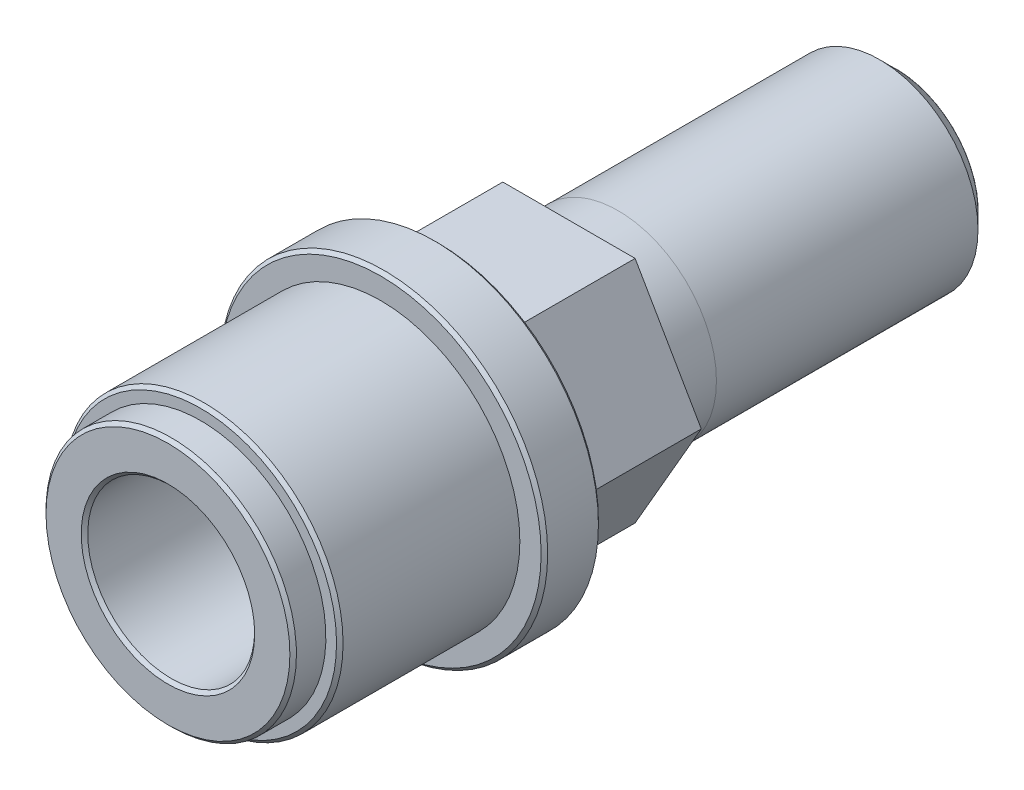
ISO-10303-21;
HEADER;
FILE_DESCRIPTION(('STEP AP214'),'2;1');
FILE_NAME('part.step','',(''),(''),'','','');
FILE_SCHEMA(('AUTOMOTIVE_DESIGN { 1 0 10303 214 1 1 1 1 }'));
ENDSEC;
DATA;
#1=APPLICATION_CONTEXT('core data for automotive mechanical design processes');
#2=APPLICATION_PROTOCOL_DEFINITION('international standard','automotive_design',2000,#1);
#3=PRODUCT_CONTEXT('',#1,'mechanical');
#4=PRODUCT('Part','Part','',(#3));
#5=PRODUCT_RELATED_PRODUCT_CATEGORY('part','',(#4));
#6=PRODUCT_DEFINITION_FORMATION('','',#4);
#7=PRODUCT_DEFINITION_CONTEXT('part definition',#1,'design');
#8=PRODUCT_DEFINITION('design','',#6,#7);
#9=PRODUCT_DEFINITION_SHAPE('','',#8);
#10=(LENGTH_UNIT() NAMED_UNIT(*) SI_UNIT(.MILLI.,.METRE.));
#11=(NAMED_UNIT(*) PLANE_ANGLE_UNIT() SI_UNIT($,.RADIAN.));
#12=(NAMED_UNIT(*) SI_UNIT($,.STERADIAN.) SOLID_ANGLE_UNIT());
#13=UNCERTAINTY_MEASURE_WITH_UNIT(LENGTH_MEASURE(1.E-05),#10,'distance_accuracy_value','');
#14=(GEOMETRIC_REPRESENTATION_CONTEXT(3) GLOBAL_UNCERTAINTY_ASSIGNED_CONTEXT((#13)) GLOBAL_UNIT_ASSIGNED_CONTEXT((#10,
#11,#12)) REPRESENTATION_CONTEXT('',''));
#15=CARTESIAN_POINT('',(0.,0.,0.));
#16=DIRECTION('',(0.,0.,1.));
#17=DIRECTION('',(1.,0.,0.));
#18=AXIS2_PLACEMENT_3D('',#15,#16,#17);
#19=CARTESIAN_POINT('',(0.505163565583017,-7.63330267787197,32.8));
#20=DIRECTION('',(0.,0.,1.));
#21=DIRECTION('',(-0.997817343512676,-0.0660344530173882,0.));
#22=AXIS2_PLACEMENT_3D('',#19,#20,#21);
#23=PLANE('',#22);
#24=CARTESIAN_POINT('',(0.,0.,32.8));
#25=DIRECTION('',(0.,0.,1.));
#26=DIRECTION('',(-0.997817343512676,-0.0660344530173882,0.));
#27=AXIS2_PLACEMENT_3D('',#24,#25,#26);
#28=CIRCLE('',#27,8.3);
#29=CARTESIAN_POINT('',(-8.28188395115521,-0.548085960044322,32.8));
#30=VERTEX_POINT('',#29);
#31=EDGE_CURVE('E9',#30,#30,#28,.T.);
#32=ORIENTED_EDGE('',*,*,#31,.T.);
#33=EDGE_LOOP('',(#32));
#34=FACE_BOUND('',#33,.T.);
#35=CARTESIAN_POINT('',(0.,0.,32.8));
#36=DIRECTION('',(0.,0.,-1.));
#37=DIRECTION('',(0.997817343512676,0.0660344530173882,0.));
#38=AXIS2_PLACEMENT_3D('',#35,#36,#37);
#39=CIRCLE('',#38,7.65);
#40=CARTESIAN_POINT('',(7.63330267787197,0.50516356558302,32.8));
#41=VERTEX_POINT('',#40);
#42=EDGE_CURVE('E139',#41,#41,#39,.T.);
#43=ORIENTED_EDGE('',*,*,#42,.T.);
#44=EDGE_LOOP('',(#43));
#45=FACE_BOUND('',#44,.T.);
#46=ADVANCED_FACE('F14',(#34,#45),#23,.T.);
#47=CARTESIAN_POINT('',(0.,0.,24.3));
#48=DIRECTION('',(0.,0.,-1.));
#49=DIRECTION('',(0.997817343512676,0.0660344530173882,0.));
#50=AXIS2_PLACEMENT_3D('',#47,#48,#49);
#51=CYLINDRICAL_SURFACE('',#50,8.5);
#52=CARTESIAN_POINT('',(0.,0.,32.6));
#53=DIRECTION('',(0.,0.,1.));
#54=DIRECTION('',(-0.997817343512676,-0.0660344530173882,0.));
#55=AXIS2_PLACEMENT_3D('',#52,#53,#54);
#56=CIRCLE('',#55,8.5);
#57=CARTESIAN_POINT('',(-8.48144741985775,-0.5612928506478,32.6));
#58=VERTEX_POINT('',#57);
#59=EDGE_CURVE('E23',#58,#58,#56,.F.);
#60=ORIENTED_EDGE('',*,*,#59,.T.);
#61=EDGE_LOOP('',(#60));
#62=FACE_BOUND('',#61,.T.);
#63=CARTESIAN_POINT('',(0.,0.,21.8));
#64=DIRECTION('',(0.,0.,-1.));
#65=DIRECTION('',(1.,0.,0.));
#66=AXIS2_PLACEMENT_3D('',#63,#64,#65);
#67=CIRCLE('',#66,8.5);
#68=CARTESIAN_POINT('',(8.5,0.,21.8));
#69=VERTEX_POINT('',#68);
#70=EDGE_CURVE('E123',#69,#69,#67,.T.);
#71=ORIENTED_EDGE('',*,*,#70,.F.);
#72=EDGE_LOOP('',(#71));
#73=FACE_BOUND('',#72,.T.);
#74=ADVANCED_FACE('F280',(#62,#73),#51,.T.);
#75=CARTESIAN_POINT('',(0.,0.,32.6));
#76=DIRECTION('',(0.,0.,-1.));
#77=DIRECTION('',(0.997817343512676,0.0660344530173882,0.));
#78=AXIS2_PLACEMENT_3D('',#75,#76,#77);
#79=CONICAL_SURFACE('',#78,8.5,0.78539816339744);
#80=ORIENTED_EDGE('',*,*,#31,.F.);
#81=EDGE_LOOP('',(#80));
#82=FACE_BOUND('',#81,.T.);
#83=ORIENTED_EDGE('',*,*,#59,.F.);
#84=EDGE_LOOP('',(#83));
#85=FACE_BOUND('',#84,.T.);
#86=ADVANCED_FACE('F282',(#82,#85),#79,.T.);
#87=CARTESIAN_POINT('',(0.,0.,-9.69));
#88=DIRECTION('',(0.,0.,1.));
#89=DIRECTION('',(-1.,0.,0.));
#90=AXIS2_PLACEMENT_3D('',#87,#88,#89);
#91=CONICAL_SURFACE('',#90,5.,0.785398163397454);
#92=CARTESIAN_POINT('',(0.,0.,-8.69));
#93=DIRECTION('',(0.,0.,-1.));
#94=DIRECTION('',(1.,0.,0.));
#95=AXIS2_PLACEMENT_3D('',#92,#93,#94);
#96=CIRCLE('',#95,6.);
#97=CARTESIAN_POINT('',(6.,0.,-8.69));
#98=VERTEX_POINT('',#97);
#99=EDGE_CURVE('E99',#98,#98,#96,.T.);
#100=ORIENTED_EDGE('',*,*,#99,.T.);
#101=EDGE_LOOP('',(#100));
#102=FACE_BOUND('',#101,.T.);
#103=CARTESIAN_POINT('',(0.,0.,-9.69));
#104=DIRECTION('',(0.,0.,-1.));
#105=DIRECTION('',(1.,0.,0.));
#106=AXIS2_PLACEMENT_3D('',#103,#104,#105);
#107=CIRCLE('',#106,5.);
#108=CARTESIAN_POINT('',(5.,0.,-9.69));
#109=VERTEX_POINT('',#108);
#110=EDGE_CURVE('E96',#109,#109,#107,.T.);
#111=ORIENTED_EDGE('',*,*,#110,.F.);
#112=EDGE_LOOP('',(#111));
#113=FACE_BOUND('',#112,.T.);
#114=ADVANCED_FACE('F248',(#102,#113),#91,.T.);
#115=CARTESIAN_POINT('',(0.,0.,2.8));
#116=DIRECTION('',(0.,0.,-1.));
#117=DIRECTION('',(1.,0.,0.));
#118=AXIS2_PLACEMENT_3D('',#115,#116,#117);
#119=CYLINDRICAL_SURFACE('',#118,6.);
#120=ORIENTED_EDGE('',*,*,#99,.F.);
#121=EDGE_LOOP('',(#120));
#122=FACE_BOUND('',#121,.T.);
#123=CARTESIAN_POINT('',(0.,0.,7.3));
#124=DIRECTION('',(0.,0.,-1.));
#125=DIRECTION('',(1.,0.,0.));
#126=AXIS2_PLACEMENT_3D('',#123,#124,#125);
#127=CIRCLE('',#126,6.);
#128=CARTESIAN_POINT('',(6.,0.,7.3));
#129=VERTEX_POINT('',#128);
#130=EDGE_CURVE('E155',#129,#129,#127,.T.);
#131=ORIENTED_EDGE('',*,*,#130,.T.);
#132=EDGE_LOOP('',(#131));
#133=FACE_BOUND('',#132,.T.);
#134=ADVANCED_FACE('F301',(#122,#133),#119,.T.);
#135=CARTESIAN_POINT('',(-6.,0.,7.3));
#136=DIRECTION('',(0.,0.,1.));
#137=DIRECTION('',(-1.,0.,0.));
#138=AXIS2_PLACEMENT_3D('',#135,#136,#137);
#139=PLANE('',#138);
#140=ORIENTED_EDGE('',*,*,#130,.F.);
#141=EDGE_LOOP('',(#140));
#142=FACE_BOUND('',#141,.T.);
#143=CARTESIAN_POINT('',(0.,0.,7.3));
#144=DIRECTION('',(0.,0.,-1.));
#145=DIRECTION('',(1.,0.,0.));
#146=AXIS2_PLACEMENT_3D('',#143,#144,#145);
#147=CIRCLE('',#146,6.01);
#148=CARTESIAN_POINT('',(6.01,0.,7.3));
#149=VERTEX_POINT('',#148);
#150=EDGE_CURVE('E152',#149,#149,#147,.T.);
#151=ORIENTED_EDGE('',*,*,#150,.T.);
#152=EDGE_LOOP('',(#151));
#153=FACE_BOUND('',#152,.T.);
#154=ADVANCED_FACE('F297',(#142,#153),#139,.F.);
#155=CARTESIAN_POINT('',(0.,0.,2.8));
#156=DIRECTION('',(0.,0.,-1.));
#157=DIRECTION('',(1.,0.,0.));
#158=AXIS2_PLACEMENT_3D('',#155,#156,#157);
#159=CYLINDRICAL_SURFACE('',#158,6.01);
#160=ORIENTED_EDGE('',*,*,#150,.F.);
#161=EDGE_LOOP('',(#160));
#162=FACE_BOUND('',#161,.T.);
#163=CARTESIAN_POINT('',(0.,0.,10.3));
#164=DIRECTION('',(0.,0.,-1.));
#165=DIRECTION('',(1.,0.,0.));
#166=AXIS2_PLACEMENT_3D('',#163,#164,#165);
#167=CIRCLE('',#166,6.01);
#168=CARTESIAN_POINT('',(6.01,0.,10.3));
#169=VERTEX_POINT('',#168);
#170=EDGE_CURVE('E149',#169,#169,#167,.T.);
#171=ORIENTED_EDGE('',*,*,#170,.T.);
#172=EDGE_LOOP('',(#171));
#173=FACE_BOUND('',#172,.T.);
#174=ADVANCED_FACE('F205',(#162,#173),#159,.T.);
#175=CARTESIAN_POINT('',(-8.5,0.,10.3));
#176=DIRECTION('',(0.,0.,-1.));
#177=DIRECTION('',(1.,0.,0.));
#178=AXIS2_PLACEMENT_3D('',#175,#176,#177);
#179=PLANE('',#178);
#180=ORIENTED_EDGE('',*,*,#170,.F.);
#181=EDGE_LOOP('',(#180));
#182=FACE_BOUND('',#181,.T.);
#183=DIRECTION('',(0.5,-0.866025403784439,0.));
#184=VECTOR('',#183,1.);
#185=CARTESIAN_POINT('',(4.04145188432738,7.,10.3));
#186=LINE('',#185,#184);
#187=CARTESIAN_POINT('',(4.04145188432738,7.,10.3));
#188=VERTEX_POINT('',#187);
#189=CARTESIAN_POINT('',(8.08290376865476,0.,10.3));
#190=VERTEX_POINT('',#189);
#191=EDGE_CURVE('E158',#188,#190,#186,.T.);
#192=ORIENTED_EDGE('',*,*,#191,.T.);
#193=DIRECTION('',(-0.5,-0.866025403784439,0.));
#194=VECTOR('',#193,1.);
#195=CARTESIAN_POINT('',(8.08290376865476,0.,10.3));
#196=LINE('',#195,#194);
#197=CARTESIAN_POINT('',(4.04145188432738,-7.,10.3));
#198=VERTEX_POINT('',#197);
#199=EDGE_CURVE('E31',#190,#198,#196,.T.);
#200=ORIENTED_EDGE('',*,*,#199,.T.);
#201=DIRECTION('',(-1.,0.,0.));
#202=VECTOR('',#201,1.);
#203=CARTESIAN_POINT('',(4.04145188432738,-7.,10.3));
#204=LINE('',#203,#202);
#205=CARTESIAN_POINT('',(-4.04145188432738,-7.,10.3));
#206=VERTEX_POINT('',#205);
#207=EDGE_CURVE('E165',#198,#206,#204,.T.);
#208=ORIENTED_EDGE('',*,*,#207,.T.);
#209=DIRECTION('',(-0.5,0.866025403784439,0.));
#210=VECTOR('',#209,1.);
#211=CARTESIAN_POINT('',(-4.04145188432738,-7.,10.3));
#212=LINE('',#211,#210);
#213=CARTESIAN_POINT('',(-8.08290376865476,0.,10.3));
#214=VERTEX_POINT('',#213);
#215=EDGE_CURVE('E168',#206,#214,#212,.T.);
#216=ORIENTED_EDGE('',*,*,#215,.T.);
#217=DIRECTION('',(0.5,0.866025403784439,0.));
#218=VECTOR('',#217,1.);
#219=CARTESIAN_POINT('',(-8.08290376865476,0.,10.3));
#220=LINE('',#219,#218);
#221=CARTESIAN_POINT('',(-4.04145188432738,7.,10.3));
#222=VERTEX_POINT('',#221);
#223=EDGE_CURVE('E79',#214,#222,#220,.T.);
#224=ORIENTED_EDGE('',*,*,#223,.T.);
#225=DIRECTION('',(1.,0.,0.));
#226=VECTOR('',#225,1.);
#227=CARTESIAN_POINT('',(-4.04145188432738,7.,10.3));
#228=LINE('',#227,#226);
#229=EDGE_CURVE('E92',#222,#188,#228,.T.);
#230=ORIENTED_EDGE('',*,*,#229,.T.);
#231=EDGE_LOOP('',(#192,#200,#208,#216,#224,#230));
#232=FACE_BOUND('',#231,.T.);
#233=ADVANCED_FACE('F184',(#182,#232),#179,.T.);
#234=CARTESIAN_POINT('',(4.04145188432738,-7.,42.582046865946));
#235=DIRECTION('',(0.,-1.,0.));
#236=DIRECTION('',(0.,0.,1.));
#237=AXIS2_PLACEMENT_3D('',#234,#235,#236);
#238=PLANE('',#237);
#239=DIRECTION('',(0.,0.,-1.));
#240=VECTOR('',#239,1.);
#241=CARTESIAN_POINT('',(-4.04145188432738,-7.,42.582046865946));
#242=LINE('',#241,#240);
#243=CARTESIAN_POINT('',(-4.04145188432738,-7.,18.3));
#244=VERTEX_POINT('',#243);
#245=EDGE_CURVE('E75',#244,#206,#242,.T.);
#246=ORIENTED_EDGE('',*,*,#245,.T.);
#247=ORIENTED_EDGE('',*,*,#207,.F.);
#248=DIRECTION('',(0.,0.,-1.));
#249=VECTOR('',#248,1.);
#250=CARTESIAN_POINT('',(4.04145188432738,-7.,42.582046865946));
#251=LINE('',#250,#249);
#252=CARTESIAN_POINT('',(4.04145188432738,-7.,18.3));
#253=VERTEX_POINT('',#252);
#254=EDGE_CURVE('E85',#253,#198,#251,.T.);
#255=ORIENTED_EDGE('',*,*,#254,.F.);
#256=DIRECTION('',(1.,0.,0.));
#257=VECTOR('',#256,1.);
#258=CARTESIAN_POINT('',(4.04145188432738,-7.,18.3));
#259=LINE('',#258,#257);
#260=EDGE_CURVE('E40',#244,#253,#259,.T.);
#261=ORIENTED_EDGE('',*,*,#260,.F.);
#262=EDGE_LOOP('',(#246,#247,#255,#261));
#263=FACE_BOUND('',#262,.T.);
#264=ADVANCED_FACE('F195',(#263),#238,.T.);
#265=CARTESIAN_POINT('',(-4.04145188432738,-7.,42.582046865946));
#266=DIRECTION('',(-0.866025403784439,-0.5,0.));
#267=DIRECTION('',(0.5,-0.866025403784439,0.));
#268=AXIS2_PLACEMENT_3D('',#265,#266,#267);
#269=PLANE('',#268);
#270=DIRECTION('',(0.,0.,-1.));
#271=VECTOR('',#270,1.);
#272=CARTESIAN_POINT('',(-8.08290376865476,0.,42.582046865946));
#273=LINE('',#272,#271);
#274=CARTESIAN_POINT('',(-8.08290376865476,0.,18.3));
#275=VERTEX_POINT('',#274);
#276=EDGE_CURVE('E72',#275,#214,#273,.T.);
#277=ORIENTED_EDGE('',*,*,#276,.T.);
#278=ORIENTED_EDGE('',*,*,#215,.F.);
#279=ORIENTED_EDGE('',*,*,#245,.F.);
#280=DIRECTION('',(0.5,-0.866025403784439,0.));
#281=VECTOR('',#280,1.);
#282=CARTESIAN_POINT('',(-4.04145188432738,-7.,18.3));
#283=LINE('',#282,#281);
#284=EDGE_CURVE('E58',#275,#244,#283,.T.);
#285=ORIENTED_EDGE('',*,*,#284,.F.);
#286=EDGE_LOOP('',(#277,#278,#279,#285));
#287=FACE_BOUND('',#286,.T.);
#288=ADVANCED_FACE('F69',(#287),#269,.T.);
#289=CARTESIAN_POINT('',(-8.08290376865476,0.,42.582046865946));
#290=DIRECTION('',(-0.866025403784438,0.5,0.));
#291=DIRECTION('',(-0.5,-0.866025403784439,0.));
#292=AXIS2_PLACEMENT_3D('',#289,#290,#291);
#293=PLANE('',#292);
#294=DIRECTION('',(0.,0.,-1.));
#295=VECTOR('',#294,1.);
#296=CARTESIAN_POINT('',(-4.04145188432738,7.,42.582046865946));
#297=LINE('',#296,#295);
#298=CARTESIAN_POINT('',(-4.04145188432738,7.,18.3));
#299=VERTEX_POINT('',#298);
#300=EDGE_CURVE('E81',#299,#222,#297,.T.);
#301=ORIENTED_EDGE('',*,*,#300,.T.);
#302=ORIENTED_EDGE('',*,*,#223,.F.);
#303=ORIENTED_EDGE('',*,*,#276,.F.);
#304=DIRECTION('',(-0.5,-0.866025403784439,0.));
#305=VECTOR('',#304,1.);
#306=CARTESIAN_POINT('',(-8.08290376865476,0.,18.3));
#307=LINE('',#306,#305);
#308=EDGE_CURVE('E55',#299,#275,#307,.T.);
#309=ORIENTED_EDGE('',*,*,#308,.F.);
#310=EDGE_LOOP('',(#301,#302,#303,#309));
#311=FACE_BOUND('',#310,.T.);
#312=ADVANCED_FACE('F77',(#311),#293,.T.);
#313=CARTESIAN_POINT('',(-4.04145188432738,7.,42.582046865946));
#314=DIRECTION('',(0.,1.,0.));
#315=DIRECTION('',(0.,0.,-1.));
#316=AXIS2_PLACEMENT_3D('',#313,#314,#315);
#317=PLANE('',#316);
#318=DIRECTION('',(0.,0.,-1.));
#319=VECTOR('',#318,1.);
#320=CARTESIAN_POINT('',(4.04145188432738,7.,42.582046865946));
#321=LINE('',#320,#319);
#322=CARTESIAN_POINT('',(4.04145188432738,7.,18.3));
#323=VERTEX_POINT('',#322);
#324=EDGE_CURVE('E83',#323,#188,#321,.T.);
#325=ORIENTED_EDGE('',*,*,#324,.T.);
#326=ORIENTED_EDGE('',*,*,#229,.F.);
#327=ORIENTED_EDGE('',*,*,#300,.F.);
#328=DIRECTION('',(-1.,0.,0.));
#329=VECTOR('',#328,1.);
#330=CARTESIAN_POINT('',(-4.04145188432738,7.,18.3));
#331=LINE('',#330,#329);
#332=EDGE_CURVE('E60',#323,#299,#331,.T.);
#333=ORIENTED_EDGE('',*,*,#332,.F.);
#334=EDGE_LOOP('',(#325,#326,#327,#333));
#335=FACE_BOUND('',#334,.T.);
#336=ADVANCED_FACE('F178',(#335),#317,.T.);
#337=CARTESIAN_POINT('',(4.04145188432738,7.,42.582046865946));
#338=DIRECTION('',(0.866025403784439,0.5,0.));
#339=DIRECTION('',(-0.5,0.866025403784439,0.));
#340=AXIS2_PLACEMENT_3D('',#337,#338,#339);
#341=PLANE('',#340);
#342=DIRECTION('',(0.,0.,-1.));
#343=VECTOR('',#342,1.);
#344=CARTESIAN_POINT('',(8.08290376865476,0.,42.582046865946));
#345=LINE('',#344,#343);
#346=CARTESIAN_POINT('',(8.08290376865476,0.,18.3));
#347=VERTEX_POINT('',#346);
#348=EDGE_CURVE('E90',#347,#190,#345,.T.);
#349=ORIENTED_EDGE('',*,*,#348,.T.);
#350=ORIENTED_EDGE('',*,*,#191,.F.);
#351=ORIENTED_EDGE('',*,*,#324,.F.);
#352=DIRECTION('',(-0.5,0.866025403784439,0.));
#353=VECTOR('',#352,1.);
#354=CARTESIAN_POINT('',(4.04145188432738,7.,18.3));
#355=LINE('',#354,#353);
#356=EDGE_CURVE('E95',#347,#323,#355,.T.);
#357=ORIENTED_EDGE('',*,*,#356,.F.);
#358=EDGE_LOOP('',(#349,#350,#351,#357));
#359=FACE_BOUND('',#358,.T.);
#360=ADVANCED_FACE('F182',(#359),#341,.T.);
#361=CARTESIAN_POINT('',(8.08290376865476,0.,42.582046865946));
#362=DIRECTION('',(0.866025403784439,-0.5,0.));
#363=DIRECTION('',(0.5,0.866025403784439,0.));
#364=AXIS2_PLACEMENT_3D('',#361,#362,#363);
#365=PLANE('',#364);
#366=ORIENTED_EDGE('',*,*,#254,.T.);
#367=ORIENTED_EDGE('',*,*,#199,.F.);
#368=ORIENTED_EDGE('',*,*,#348,.F.);
#369=DIRECTION('',(0.5,0.866025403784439,0.));
#370=VECTOR('',#369,1.);
#371=CARTESIAN_POINT('',(8.08290376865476,0.,18.3));
#372=LINE('',#371,#370);
#373=EDGE_CURVE('E93',#253,#347,#372,.T.);
#374=ORIENTED_EDGE('',*,*,#373,.F.);
#375=EDGE_LOOP('',(#366,#367,#368,#374));
#376=FACE_BOUND('',#375,.T.);
#377=ADVANCED_FACE('F193',(#376),#365,.T.);
#378=CARTESIAN_POINT('',(7.65,0.,18.3));
#379=DIRECTION('',(0.,0.,-1.));
#380=DIRECTION('',(1.,0.,0.));
#381=AXIS2_PLACEMENT_3D('',#378,#379,#380);
#382=PLANE('',#381);
#383=CARTESIAN_POINT('',(0.,0.,18.3));
#384=DIRECTION('',(0.,0.,-1.));
#385=DIRECTION('',(1.,0.,0.));
#386=AXIS2_PLACEMENT_3D('',#383,#384,#385);
#387=CIRCLE('',#386,9.8);
#388=CARTESIAN_POINT('',(9.8,0.,18.3));
#389=VERTEX_POINT('',#388);
#390=EDGE_CURVE('E126',#389,#389,#387,.T.);
#391=ORIENTED_EDGE('',*,*,#390,.T.);
#392=EDGE_LOOP('',(#391));
#393=FACE_BOUND('',#392,.T.);
#394=ORIENTED_EDGE('',*,*,#373,.T.);
#395=ORIENTED_EDGE('',*,*,#356,.T.);
#396=ORIENTED_EDGE('',*,*,#332,.T.);
#397=ORIENTED_EDGE('',*,*,#308,.T.);
#398=ORIENTED_EDGE('',*,*,#284,.T.);
#399=ORIENTED_EDGE('',*,*,#260,.T.);
#400=EDGE_LOOP('',(#394,#395,#396,#397,#398,#399));
#401=FACE_BOUND('',#400,.T.);
#402=ADVANCED_FACE('F57',(#393,#401),#382,.T.);
#403=CARTESIAN_POINT('',(0.,0.,18.3));
#404=DIRECTION('',(0.,0.,1.));
#405=DIRECTION('',(-1.,0.,0.));
#406=AXIS2_PLACEMENT_3D('',#403,#404,#405);
#407=CONICAL_SURFACE('',#406,9.8,0.785398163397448);
#408=CARTESIAN_POINT('',(0.,0.,18.5));
#409=DIRECTION('',(0.,0.,-1.));
#410=DIRECTION('',(1.,0.,0.));
#411=AXIS2_PLACEMENT_3D('',#408,#409,#410);
#412=CIRCLE('',#411,10.);
#413=CARTESIAN_POINT('',(10.,0.,18.5));
#414=VERTEX_POINT('',#413);
#415=EDGE_CURVE('E132',#414,#414,#412,.F.);
#416=ORIENTED_EDGE('',*,*,#415,.F.);
#417=EDGE_LOOP('',(#416));
#418=FACE_BOUND('',#417,.T.);
#419=ORIENTED_EDGE('',*,*,#390,.F.);
#420=EDGE_LOOP('',(#419));
#421=FACE_BOUND('',#420,.T.);
#422=ADVANCED_FACE('F222',(#418,#421),#407,.T.);
#423=CARTESIAN_POINT('',(0.,0.,2.8));
#424=DIRECTION('',(0.,0.,-1.));
#425=DIRECTION('',(1.,0.,0.));
#426=AXIS2_PLACEMENT_3D('',#423,#424,#425);
#427=CYLINDRICAL_SURFACE('',#426,10.);
#428=ORIENTED_EDGE('',*,*,#415,.T.);
#429=EDGE_LOOP('',(#428));
#430=FACE_BOUND('',#429,.T.);
#431=CARTESIAN_POINT('',(0.,0.,21.6));
#432=DIRECTION('',(0.,0.,-1.));
#433=DIRECTION('',(1.,0.,0.));
#434=AXIS2_PLACEMENT_3D('',#431,#432,#433);
#435=CIRCLE('',#434,10.);
#436=CARTESIAN_POINT('',(10.,0.,21.6));
#437=VERTEX_POINT('',#436);
#438=EDGE_CURVE('E129',#437,#437,#435,.T.);
#439=ORIENTED_EDGE('',*,*,#438,.T.);
#440=EDGE_LOOP('',(#439));
#441=FACE_BOUND('',#440,.T.);
#442=ADVANCED_FACE('F259',(#430,#441),#427,.T.);
#443=CARTESIAN_POINT('',(0.,0.,21.6));
#444=DIRECTION('',(0.,0.,-1.));
#445=DIRECTION('',(1.,0.,0.));
#446=AXIS2_PLACEMENT_3D('',#443,#444,#445);
#447=CONICAL_SURFACE('',#446,10.,0.785398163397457);
#448=CARTESIAN_POINT('',(0.,0.,21.8));
#449=DIRECTION('',(0.,0.,-1.));
#450=DIRECTION('',(1.,0.,0.));
#451=AXIS2_PLACEMENT_3D('',#448,#449,#450);
#452=CIRCLE('',#451,9.8);
#453=CARTESIAN_POINT('',(9.8,0.,21.8));
#454=VERTEX_POINT('',#453);
#455=EDGE_CURVE('E135',#454,#454,#452,.F.);
#456=ORIENTED_EDGE('',*,*,#455,.F.);
#457=EDGE_LOOP('',(#456));
#458=FACE_BOUND('',#457,.T.);
#459=ORIENTED_EDGE('',*,*,#438,.F.);
#460=EDGE_LOOP('',(#459));
#461=FACE_BOUND('',#460,.T.);
#462=ADVANCED_FACE('F261',(#458,#461),#447,.T.);
#463=CARTESIAN_POINT('',(-8.5,0.,21.8));
#464=DIRECTION('',(0.,0.,-1.));
#465=DIRECTION('',(1.,0.,0.));
#466=AXIS2_PLACEMENT_3D('',#463,#464,#465);
#467=PLANE('',#466);
#468=ORIENTED_EDGE('',*,*,#455,.T.);
#469=EDGE_LOOP('',(#468));
#470=FACE_BOUND('',#469,.T.);
#471=ORIENTED_EDGE('',*,*,#70,.T.);
#472=EDGE_LOOP('',(#471));
#473=FACE_BOUND('',#472,.T.);
#474=ADVANCED_FACE('F239',(#470,#473),#467,.F.);
#475=CARTESIAN_POINT('',(0.,0.,39.976972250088));
#476=DIRECTION('',(0.,0.,1.));
#477=DIRECTION('',(-1.,0.,0.));
#478=AXIS2_PLACEMENT_3D('',#475,#476,#477);
#479=CYLINDRICAL_SURFACE('',#478,5.);
#480=CARTESIAN_POINT('',(0.,0.,-9.699));
#481=DIRECTION('',(0.,0.,1.));
#482=DIRECTION('',(-1.,0.,0.));
#483=AXIS2_PLACEMENT_3D('',#480,#481,#482);
#484=CIRCLE('',#483,5.);
#485=CARTESIAN_POINT('',(-5.,0.,-9.699));
#486=VERTEX_POINT('',#485);
#487=EDGE_CURVE('E105',#486,#486,#484,.T.);
#488=ORIENTED_EDGE('',*,*,#487,.T.);
#489=EDGE_LOOP('',(#488));
#490=FACE_BOUND('',#489,.T.);
#491=ORIENTED_EDGE('',*,*,#110,.T.);
#492=EDGE_LOOP('',(#491));
#493=FACE_BOUND('',#492,.T.);
#494=ADVANCED_FACE('F244',(#490,#493),#479,.T.);
#495=CARTESIAN_POINT('',(0.,0.,-9.699));
#496=DIRECTION('',(0.,0.,1.));
#497=DIRECTION('',(-1.,0.,0.));
#498=AXIS2_PLACEMENT_3D('',#495,#496,#497);
#499=CONICAL_SURFACE('',#498,5.,0.78539816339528);
#500=CARTESIAN_POINT('',(0.,0.,-9.7));
#501=DIRECTION('',(0.,0.,1.));
#502=DIRECTION('',(-1.,0.,0.));
#503=AXIS2_PLACEMENT_3D('',#500,#501,#502);
#504=CIRCLE('',#503,4.999);
#505=CARTESIAN_POINT('',(-4.999,0.,-9.7));
#506=VERTEX_POINT('',#505);
#507=EDGE_CURVE('E108',#506,#506,#504,.F.);
#508=ORIENTED_EDGE('',*,*,#507,.F.);
#509=EDGE_LOOP('',(#508));
#510=FACE_BOUND('',#509,.T.);
#511=ORIENTED_EDGE('',*,*,#487,.F.);
#512=EDGE_LOOP('',(#511));
#513=FACE_BOUND('',#512,.T.);
#514=ADVANCED_FACE('F223',(#510,#513),#499,.T.);
#515=CARTESIAN_POINT('',(5.,0.,-9.7));
#516=DIRECTION('',(0.,0.,1.));
#517=DIRECTION('',(-1.,0.,0.));
#518=AXIS2_PLACEMENT_3D('',#515,#516,#517);
#519=PLANE('',#518);
#520=ORIENTED_EDGE('',*,*,#507,.T.);
#521=EDGE_LOOP('',(#520));
#522=FACE_BOUND('',#521,.T.);
#523=CARTESIAN_POINT('',(0.,0.,-9.7));
#524=DIRECTION('',(0.,0.,1.));
#525=DIRECTION('',(-1.,0.,0.));
#526=AXIS2_PLACEMENT_3D('',#523,#524,#525);
#527=CIRCLE('',#526,4.25);
#528=CARTESIAN_POINT('',(-4.25,0.,-9.7));
#529=VERTEX_POINT('',#528);
#530=EDGE_CURVE('E102',#529,#529,#527,.T.);
#531=ORIENTED_EDGE('',*,*,#530,.T.);
#532=EDGE_LOOP('',(#531));
#533=FACE_BOUND('',#532,.T.);
#534=ADVANCED_FACE('F212',(#522,#533),#519,.F.);
#535=CARTESIAN_POINT('',(0.,0.,29.7946490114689));
#536=DIRECTION('',(0.,0.,1.));
#537=DIRECTION('',(-1.,0.,0.));
#538=AXIS2_PLACEMENT_3D('',#535,#536,#537);
#539=CYLINDRICAL_SURFACE('',#538,4.25);
#540=ORIENTED_EDGE('',*,*,#530,.F.);
#541=EDGE_LOOP('',(#540));
#542=FACE_BOUND('',#541,.T.);
#543=CARTESIAN_POINT('',(0.,0.,18.6511));
#544=DIRECTION('',(0.,0.,1.));
#545=DIRECTION('',(-1.,0.,0.));
#546=AXIS2_PLACEMENT_3D('',#543,#544,#545);
#547=CIRCLE('',#546,4.25);
#548=CARTESIAN_POINT('',(-4.25,0.,18.6511));
#549=VERTEX_POINT('',#548);
#550=EDGE_CURVE('E18',#549,#549,#547,.T.);
#551=ORIENTED_EDGE('',*,*,#550,.T.);
#552=EDGE_LOOP('',(#551));
#553=FACE_BOUND('',#552,.T.);
#554=ADVANCED_FACE('F210',(#542,#553),#539,.F.);
#555=CARTESIAN_POINT('',(0.,0.,18.6511));
#556=DIRECTION('',(0.,0.,1.));
#557=DIRECTION('',(0.,-1.,0.));
#558=AXIS2_PLACEMENT_3D('',#555,#556,#557);
#559=PLANE('',#558);
#560=ORIENTED_EDGE('',*,*,#550,.F.);
#561=EDGE_LOOP('',(#560));
#562=FACE_BOUND('',#561,.T.);
#563=CARTESIAN_POINT('',(0.,0.,18.6511));
#564=DIRECTION('',(0.,0.,1.));
#565=DIRECTION('',(0.,-1.,0.));
#566=AXIS2_PLACEMENT_3D('',#563,#564,#565);
#567=CIRCLE('',#566,5.1);
#568=CARTESIAN_POINT('',(0.,-5.1,18.6511));
#569=VERTEX_POINT('',#568);
#570=EDGE_CURVE('E137',#569,#569,#567,.T.);
#571=ORIENTED_EDGE('',*,*,#570,.T.);
#572=EDGE_LOOP('',(#571));
#573=FACE_BOUND('',#572,.T.);
#574=ADVANCED_FACE('F16',(#562,#573),#559,.T.);
#575=CARTESIAN_POINT('',(0.,0.,29.7946490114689));
#576=DIRECTION('',(0.,0.,1.));
#577=DIRECTION('',(-1.,0.,0.));
#578=AXIS2_PLACEMENT_3D('',#575,#576,#577);
#579=CYLINDRICAL_SURFACE('',#578,5.1);
#580=ORIENTED_EDGE('',*,*,#570,.F.);
#581=EDGE_LOOP('',(#580));
#582=FACE_BOUND('',#581,.T.);
#583=CARTESIAN_POINT('',(0.,0.,34.6));
#584=DIRECTION('',(0.,0.,-1.));
#585=DIRECTION('',(1.,0.,0.));
#586=AXIS2_PLACEMENT_3D('',#583,#584,#585);
#587=CIRCLE('',#586,5.1);
#588=CARTESIAN_POINT('',(5.1,0.,34.6));
#589=VERTEX_POINT('',#588);
#590=EDGE_CURVE('E117',#589,#589,#587,.F.);
#591=ORIENTED_EDGE('',*,*,#590,.T.);
#592=EDGE_LOOP('',(#591));
#593=FACE_BOUND('',#592,.T.);
#594=ADVANCED_FACE('F220',(#582,#593),#579,.F.);
#595=CARTESIAN_POINT('',(0.,0.,34.6));
#596=DIRECTION('',(0.,0.,1.));
#597=DIRECTION('',(-1.,0.,0.));
#598=AXIS2_PLACEMENT_3D('',#595,#596,#597);
#599=CONICAL_SURFACE('',#598,5.1,0.785398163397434);
#600=CARTESIAN_POINT('',(0.,0.,34.8));
#601=DIRECTION('',(0.,0.,-1.));
#602=DIRECTION('',(1.,0.,0.));
#603=AXIS2_PLACEMENT_3D('',#600,#601,#602);
#604=CIRCLE('',#603,5.3);
#605=CARTESIAN_POINT('',(5.3,0.,34.8));
#606=VERTEX_POINT('',#605);
#607=EDGE_CURVE('E120',#606,#606,#604,.T.);
#608=ORIENTED_EDGE('',*,*,#607,.F.);
#609=EDGE_LOOP('',(#608));
#610=FACE_BOUND('',#609,.T.);
#611=ORIENTED_EDGE('',*,*,#590,.F.);
#612=EDGE_LOOP('',(#611));
#613=FACE_BOUND('',#612,.T.);
#614=ADVANCED_FACE('F232',(#610,#613),#599,.F.);
#615=CARTESIAN_POINT('',(7.65,0.,34.8));
#616=DIRECTION('',(0.,0.,-1.));
#617=DIRECTION('',(1.,0.,0.));
#618=AXIS2_PLACEMENT_3D('',#615,#616,#617);
#619=PLANE('',#618);
#620=ORIENTED_EDGE('',*,*,#607,.T.);
#621=EDGE_LOOP('',(#620));
#622=FACE_BOUND('',#621,.T.);
#623=CARTESIAN_POINT('',(0.,0.,34.8));
#624=DIRECTION('',(0.,0.,-1.));
#625=DIRECTION('',(1.,0.,0.));
#626=AXIS2_PLACEMENT_3D('',#623,#624,#625);
#627=CIRCLE('',#626,7.45);
#628=CARTESIAN_POINT('',(7.45,0.,34.8));
#629=VERTEX_POINT('',#628);
#630=EDGE_CURVE('E111',#629,#629,#627,.F.);
#631=ORIENTED_EDGE('',*,*,#630,.T.);
#632=EDGE_LOOP('',(#631));
#633=FACE_BOUND('',#632,.T.);
#634=ADVANCED_FACE('F240',(#622,#633),#619,.F.);
#635=CARTESIAN_POINT('',(0.,0.,34.8));
#636=DIRECTION('',(0.,0.,-1.));
#637=DIRECTION('',(1.,0.,0.));
#638=AXIS2_PLACEMENT_3D('',#635,#636,#637);
#639=CONICAL_SURFACE('',#638,7.45,0.785398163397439);
#640=CARTESIAN_POINT('',(0.,0.,34.6));
#641=DIRECTION('',(0.,0.,-1.));
#642=DIRECTION('',(1.,0.,0.));
#643=AXIS2_PLACEMENT_3D('',#640,#641,#642);
#644=CIRCLE('',#643,7.65);
#645=CARTESIAN_POINT('',(7.65,0.,34.6));
#646=VERTEX_POINT('',#645);
#647=EDGE_CURVE('E114',#646,#646,#644,.T.);
#648=ORIENTED_EDGE('',*,*,#647,.F.);
#649=EDGE_LOOP('',(#648));
#650=FACE_BOUND('',#649,.T.);
#651=ORIENTED_EDGE('',*,*,#630,.F.);
#652=EDGE_LOOP('',(#651));
#653=FACE_BOUND('',#652,.T.);
#654=ADVANCED_FACE('F237',(#650,#653),#639,.T.);
#655=CARTESIAN_POINT('',(0.,0.,39.976972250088));
#656=DIRECTION('',(0.,0.,1.));
#657=DIRECTION('',(-1.,0.,0.));
#658=AXIS2_PLACEMENT_3D('',#655,#656,#657);
#659=CYLINDRICAL_SURFACE('',#658,7.65);
#660=ORIENTED_EDGE('',*,*,#42,.F.);
#661=EDGE_LOOP('',(#660));
#662=FACE_BOUND('',#661,.T.);
#663=ORIENTED_EDGE('',*,*,#647,.T.);
#664=EDGE_LOOP('',(#663));
#665=FACE_BOUND('',#664,.T.);
#666=ADVANCED_FACE('F234',(#662,#665),#659,.T.);
#667=CLOSED_SHELL('',(#46,#74,#86,#114,#134,#154,#174,#233,#264,#288,#312,#336,#360,#377,#402,
#422,#442,#462,#474,#494,#514,#534,#554,#574,#594,#614,#634,#654,#666));
#668=MANIFOLD_SOLID_BREP('B1',#667);
#669=ADVANCED_BREP_SHAPE_REPRESENTATION('',(#18,#668),#14);
#670=SHAPE_DEFINITION_REPRESENTATION(#9,#669);
ENDSEC;
END-ISO-10303-21;
